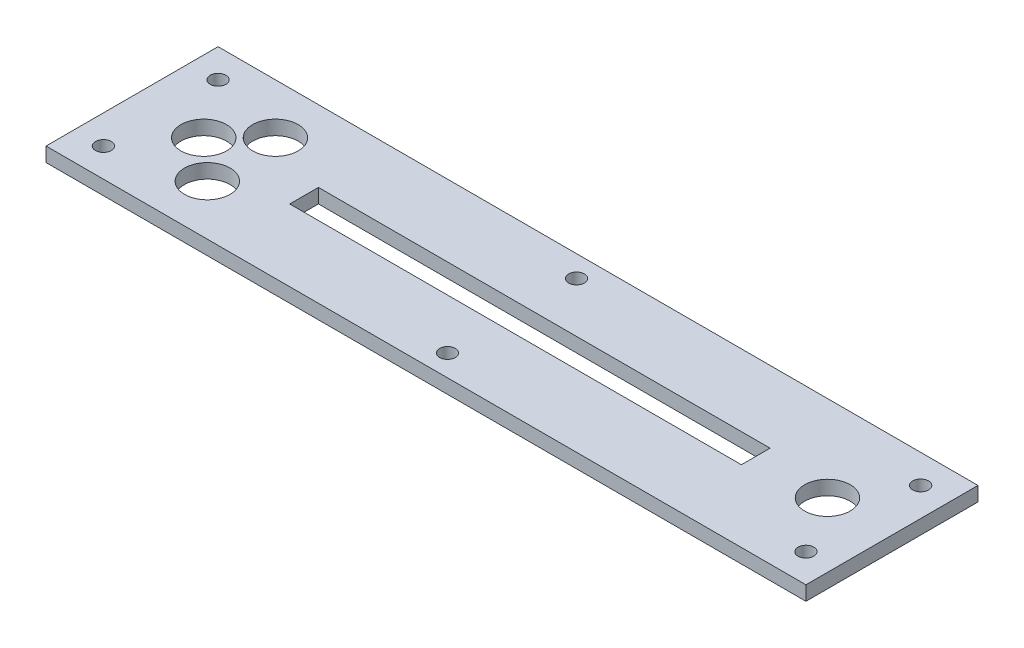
ISO-10303-21;
HEADER;
FILE_DESCRIPTION(('STEP AP214'),'2;1');
FILE_NAME('part.step','',(''),(''),'','','');
FILE_SCHEMA(('AUTOMOTIVE_DESIGN { 1 0 10303 214 1 1 1 1 }'));
ENDSEC;
DATA;
#1=APPLICATION_CONTEXT('core data for automotive mechanical design processes');
#2=APPLICATION_PROTOCOL_DEFINITION('international standard','automotive_design',2000,#1);
#3=PRODUCT_CONTEXT('',#1,'mechanical');
#4=PRODUCT('Part','Part','',(#3));
#5=PRODUCT_RELATED_PRODUCT_CATEGORY('part','',(#4));
#6=PRODUCT_DEFINITION_FORMATION('','',#4);
#7=PRODUCT_DEFINITION_CONTEXT('part definition',#1,'design');
#8=PRODUCT_DEFINITION('design','',#6,#7);
#9=PRODUCT_DEFINITION_SHAPE('','',#8);
#10=(LENGTH_UNIT() NAMED_UNIT(*) SI_UNIT(.MILLI.,.METRE.));
#11=(NAMED_UNIT(*) PLANE_ANGLE_UNIT() SI_UNIT($,.RADIAN.));
#12=(NAMED_UNIT(*) SI_UNIT($,.STERADIAN.) SOLID_ANGLE_UNIT());
#13=UNCERTAINTY_MEASURE_WITH_UNIT(LENGTH_MEASURE(1.E-05),#10,'distance_accuracy_value','');
#14=(GEOMETRIC_REPRESENTATION_CONTEXT(3) GLOBAL_UNCERTAINTY_ASSIGNED_CONTEXT((#13)) GLOBAL_UNIT_ASSIGNED_CONTEXT((#10,
#11,#12)) REPRESENTATION_CONTEXT('',''));
#15=CARTESIAN_POINT('',(0.,0.,0.));
#16=DIRECTION('',(0.,0.,1.));
#17=DIRECTION('',(1.,0.,0.));
#18=AXIS2_PLACEMENT_3D('',#15,#16,#17);
#19=CARTESIAN_POINT('',(0.,2.,0.));
#20=DIRECTION('',(0.,1.,0.));
#21=DIRECTION('',(0.,0.,1.));
#22=AXIS2_PLACEMENT_3D('',#19,#20,#21);
#23=PLANE('',#22);
#24=CARTESIAN_POINT('',(-0.5,2.,9.00000000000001));
#25=DIRECTION('',(0.,1.,0.));
#26=DIRECTION('',(0.,0.,1.));
#27=AXIS2_PLACEMENT_3D('',#24,#25,#26);
#28=CIRCLE('',#27,1.1);
#29=CARTESIAN_POINT('',(-0.5,2.,10.1));
#30=VERTEX_POINT('',#29);
#31=EDGE_CURVE('E270',#30,#30,#28,.T.);
#32=ORIENTED_EDGE('',*,*,#31,.F.);
#33=EDGE_LOOP('',(#32));
#34=FACE_BOUND('',#33,.T.);
#35=CARTESIAN_POINT('',(48.5,2.,8.));
#36=DIRECTION('',(0.,1.,0.));
#37=DIRECTION('',(0.,0.,1.));
#38=AXIS2_PLACEMENT_3D('',#35,#36,#37);
#39=CIRCLE('',#38,1.1);
#40=CARTESIAN_POINT('',(48.5,2.,9.1));
#41=VERTEX_POINT('',#40);
#42=EDGE_CURVE('E282',#41,#41,#39,.T.);
#43=ORIENTED_EDGE('',*,*,#42,.F.);
#44=EDGE_LOOP('',(#43));
#45=FACE_BOUND('',#44,.T.);
#46=CARTESIAN_POINT('',(-38.,2.,5.));
#47=DIRECTION('',(0.,1.,0.));
#48=DIRECTION('',(0.,0.,1.));
#49=AXIS2_PLACEMENT_3D('',#46,#47,#48);
#50=CIRCLE('',#49,3.18);
#51=CARTESIAN_POINT('',(-38.,2.,8.18));
#52=VERTEX_POINT('',#51);
#53=EDGE_CURVE('E294',#52,#52,#50,.T.);
#54=ORIENTED_EDGE('',*,*,#53,.F.);
#55=EDGE_LOOP('',(#54));
#56=FACE_BOUND('',#55,.T.);
#57=CARTESIAN_POINT('',(-38.5,2.,-5.));
#58=DIRECTION('',(0.,1.,0.));
#59=DIRECTION('',(0.,0.,1.));
#60=AXIS2_PLACEMENT_3D('',#57,#58,#59);
#61=CIRCLE('',#60,3.18);
#62=CARTESIAN_POINT('',(-38.5,2.,-1.82));
#63=VERTEX_POINT('',#62);
#64=EDGE_CURVE('E306',#63,#63,#61,.T.);
#65=ORIENTED_EDGE('',*,*,#64,.F.);
#66=EDGE_LOOP('',(#65));
#67=FACE_BOUND('',#66,.T.);
#68=CARTESIAN_POINT('',(-49.5,2.,-7.99999999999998));
#69=DIRECTION('',(0.,1.,0.));
#70=DIRECTION('',(0.,0.,1.));
#71=AXIS2_PLACEMENT_3D('',#68,#69,#70);
#72=CIRCLE('',#71,1.1);
#73=CARTESIAN_POINT('',(-49.5,2.,-6.89999999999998));
#74=VERTEX_POINT('',#73);
#75=EDGE_CURVE('E127',#74,#74,#72,.T.);
#76=ORIENTED_EDGE('',*,*,#75,.F.);
#77=EDGE_LOOP('',(#76));
#78=FACE_BOUND('',#77,.T.);
#79=DIRECTION('',(-1.,0.,0.));
#80=VECTOR('',#79,1.);
#81=CARTESIAN_POINT('',(52.5,2.,-12.));
#82=LINE('',#81,#80);
#83=CARTESIAN_POINT('',(52.5,2.,-12.));
#84=VERTEX_POINT('',#83);
#85=CARTESIAN_POINT('',(-53.5,2.,-12.));
#86=VERTEX_POINT('',#85);
#87=EDGE_CURVE('E137',#84,#86,#82,.T.);
#88=ORIENTED_EDGE('',*,*,#87,.T.);
#89=DIRECTION('',(0.,0.,1.));
#90=VECTOR('',#89,1.);
#91=CARTESIAN_POINT('',(-53.5,2.,-12.));
#92=LINE('',#91,#90);
#93=CARTESIAN_POINT('',(-53.5,2.,12.));
#94=VERTEX_POINT('',#93);
#95=EDGE_CURVE('E140',#86,#94,#92,.T.);
#96=ORIENTED_EDGE('',*,*,#95,.T.);
#97=DIRECTION('',(1.,0.,0.));
#98=VECTOR('',#97,1.);
#99=CARTESIAN_POINT('',(52.5,2.,12.));
#100=LINE('',#99,#98);
#101=CARTESIAN_POINT('',(52.5,2.,12.));
#102=VERTEX_POINT('',#101);
#103=EDGE_CURVE('E143',#94,#102,#100,.T.);
#104=ORIENTED_EDGE('',*,*,#103,.T.);
#105=DIRECTION('',(0.,0.,-1.));
#106=VECTOR('',#105,1.);
#107=CARTESIAN_POINT('',(52.5,2.,12.));
#108=LINE('',#107,#106);
#109=EDGE_CURVE('E145',#102,#84,#108,.T.);
#110=ORIENTED_EDGE('',*,*,#109,.T.);
#111=EDGE_LOOP('',(#88,#96,#104,#110));
#112=FACE_BOUND('',#111,.T.);
#113=DIRECTION('',(1.,0.,0.));
#114=VECTOR('',#113,1.);
#115=CARTESIAN_POINT('',(-29.5,2.,2.));
#116=LINE('',#115,#114);
#117=CARTESIAN_POINT('',(-29.5,2.,2.));
#118=VERTEX_POINT('',#117);
#119=CARTESIAN_POINT('',(33.5,2.,2.));
#120=VERTEX_POINT('',#119);
#121=EDGE_CURVE('E106',#118,#120,#116,.T.);
#122=ORIENTED_EDGE('',*,*,#121,.F.);
#123=DIRECTION('',(0.,0.,1.));
#124=VECTOR('',#123,1.);
#125=CARTESIAN_POINT('',(-29.5,2.,-2.));
#126=LINE('',#125,#124);
#127=CARTESIAN_POINT('',(-29.5,2.,-2.));
#128=VERTEX_POINT('',#127);
#129=EDGE_CURVE('E98',#128,#118,#126,.T.);
#130=ORIENTED_EDGE('',*,*,#129,.F.);
#131=DIRECTION('',(-1.,0.,0.));
#132=VECTOR('',#131,1.);
#133=CARTESIAN_POINT('',(-29.5,2.,-2.));
#134=LINE('',#133,#132);
#135=CARTESIAN_POINT('',(33.5,2.,-2.));
#136=VERTEX_POINT('',#135);
#137=EDGE_CURVE('E121',#136,#128,#134,.T.);
#138=ORIENTED_EDGE('',*,*,#137,.F.);
#139=DIRECTION('',(0.,0.,-1.));
#140=VECTOR('',#139,1.);
#141=CARTESIAN_POINT('',(33.5,2.,-2.));
#142=LINE('',#141,#140);
#143=EDGE_CURVE('E119',#120,#136,#142,.T.);
#144=ORIENTED_EDGE('',*,*,#143,.F.);
#145=EDGE_LOOP('',(#122,#130,#138,#144));
#146=FACE_BOUND('',#145,.T.);
#147=CARTESIAN_POINT('',(-49.5,2.,8.00000000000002));
#148=DIRECTION('',(0.,1.,0.));
#149=DIRECTION('',(0.,0.,1.));
#150=AXIS2_PLACEMENT_3D('',#147,#148,#149);
#151=CIRCLE('',#150,1.1);
#152=CARTESIAN_POINT('',(-49.5,2.,9.10000000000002));
#153=VERTEX_POINT('',#152);
#154=EDGE_CURVE('E312',#153,#153,#151,.T.);
#155=ORIENTED_EDGE('',*,*,#154,.F.);
#156=EDGE_LOOP('',(#155));
#157=FACE_BOUND('',#156,.T.);
#158=CARTESIAN_POINT('',(-43.5,2.,0.));
#159=DIRECTION('',(0.,1.,0.));
#160=DIRECTION('',(0.,0.,1.));
#161=AXIS2_PLACEMENT_3D('',#158,#159,#160);
#162=CIRCLE('',#161,3.18);
#163=CARTESIAN_POINT('',(-43.5,2.,3.18000000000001));
#164=VERTEX_POINT('',#163);
#165=EDGE_CURVE('E300',#164,#164,#162,.T.);
#166=ORIENTED_EDGE('',*,*,#165,.F.);
#167=EDGE_LOOP('',(#166));
#168=FACE_BOUND('',#167,.T.);
#169=CARTESIAN_POINT('',(43.5,2.,0.));
#170=DIRECTION('',(0.,1.,0.));
#171=DIRECTION('',(0.,0.,1.));
#172=AXIS2_PLACEMENT_3D('',#169,#170,#171);
#173=CIRCLE('',#172,3.18);
#174=CARTESIAN_POINT('',(43.5,2.,3.18));
#175=VERTEX_POINT('',#174);
#176=EDGE_CURVE('E288',#175,#175,#173,.T.);
#177=ORIENTED_EDGE('',*,*,#176,.F.);
#178=EDGE_LOOP('',(#177));
#179=FACE_BOUND('',#178,.T.);
#180=CARTESIAN_POINT('',(48.5,2.,-8.));
#181=DIRECTION('',(0.,1.,0.));
#182=DIRECTION('',(0.,0.,1.));
#183=AXIS2_PLACEMENT_3D('',#180,#181,#182);
#184=CIRCLE('',#183,1.1);
#185=CARTESIAN_POINT('',(48.5,2.,-6.9));
#186=VERTEX_POINT('',#185);
#187=EDGE_CURVE('E276',#186,#186,#184,.T.);
#188=ORIENTED_EDGE('',*,*,#187,.F.);
#189=EDGE_LOOP('',(#188));
#190=FACE_BOUND('',#189,.T.);
#191=CARTESIAN_POINT('',(-0.5,2.,-8.99999999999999));
#192=DIRECTION('',(0.,1.,0.));
#193=DIRECTION('',(0.,0.,1.));
#194=AXIS2_PLACEMENT_3D('',#191,#192,#193);
#195=CIRCLE('',#194,1.1);
#196=CARTESIAN_POINT('',(-0.5,2.,-7.89999999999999));
#197=VERTEX_POINT('',#196);
#198=EDGE_CURVE('E261',#197,#197,#195,.T.);
#199=ORIENTED_EDGE('',*,*,#198,.F.);
#200=EDGE_LOOP('',(#199));
#201=FACE_BOUND('',#200,.T.);
#202=ADVANCED_FACE('F33',(#34,#45,#56,#67,#78,#112,#146,#157,#168,#179,#190,#201),#23,.T.);
#203=CARTESIAN_POINT('',(0.,0.,0.));
#204=DIRECTION('',(0.,1.,0.));
#205=DIRECTION('',(0.,0.,1.));
#206=AXIS2_PLACEMENT_3D('',#203,#204,#205);
#207=PLANE('',#206);
#208=CARTESIAN_POINT('',(-0.5,0.,9.00000000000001));
#209=DIRECTION('',(0.,1.,0.));
#210=DIRECTION('',(0.,0.,1.));
#211=AXIS2_PLACEMENT_3D('',#208,#209,#210);
#212=CIRCLE('',#211,1.1);
#213=CARTESIAN_POINT('',(-0.5,0.,10.1));
#214=VERTEX_POINT('',#213);
#215=EDGE_CURVE('E267',#214,#214,#212,.T.);
#216=ORIENTED_EDGE('',*,*,#215,.T.);
#217=EDGE_LOOP('',(#216));
#218=FACE_BOUND('',#217,.T.);
#219=CARTESIAN_POINT('',(48.5,0.,8.));
#220=DIRECTION('',(0.,1.,0.));
#221=DIRECTION('',(0.,0.,1.));
#222=AXIS2_PLACEMENT_3D('',#219,#220,#221);
#223=CIRCLE('',#222,1.1);
#224=CARTESIAN_POINT('',(48.5,0.,9.1));
#225=VERTEX_POINT('',#224);
#226=EDGE_CURVE('E279',#225,#225,#223,.T.);
#227=ORIENTED_EDGE('',*,*,#226,.T.);
#228=EDGE_LOOP('',(#227));
#229=FACE_BOUND('',#228,.T.);
#230=CARTESIAN_POINT('',(-38.,0.,5.));
#231=DIRECTION('',(0.,1.,0.));
#232=DIRECTION('',(0.,0.,1.));
#233=AXIS2_PLACEMENT_3D('',#230,#231,#232);
#234=CIRCLE('',#233,3.18);
#235=CARTESIAN_POINT('',(-38.,0.,8.18));
#236=VERTEX_POINT('',#235);
#237=EDGE_CURVE('E291',#236,#236,#234,.T.);
#238=ORIENTED_EDGE('',*,*,#237,.T.);
#239=EDGE_LOOP('',(#238));
#240=FACE_BOUND('',#239,.T.);
#241=CARTESIAN_POINT('',(-38.5,0.,-5.));
#242=DIRECTION('',(0.,1.,0.));
#243=DIRECTION('',(0.,0.,1.));
#244=AXIS2_PLACEMENT_3D('',#241,#242,#243);
#245=CIRCLE('',#244,3.18);
#246=CARTESIAN_POINT('',(-38.5,0.,-1.82));
#247=VERTEX_POINT('',#246);
#248=EDGE_CURVE('E303',#247,#247,#245,.T.);
#249=ORIENTED_EDGE('',*,*,#248,.T.);
#250=EDGE_LOOP('',(#249));
#251=FACE_BOUND('',#250,.T.);
#252=CARTESIAN_POINT('',(-49.5,0.,-7.99999999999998));
#253=DIRECTION('',(0.,1.,0.));
#254=DIRECTION('',(0.,0.,1.));
#255=AXIS2_PLACEMENT_3D('',#252,#253,#254);
#256=CIRCLE('',#255,1.1);
#257=CARTESIAN_POINT('',(-49.5,0.,-6.89999999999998));
#258=VERTEX_POINT('',#257);
#259=EDGE_CURVE('E315',#258,#258,#256,.T.);
#260=ORIENTED_EDGE('',*,*,#259,.T.);
#261=EDGE_LOOP('',(#260));
#262=FACE_BOUND('',#261,.T.);
#263=DIRECTION('',(-1.,0.,0.));
#264=VECTOR('',#263,1.);
#265=CARTESIAN_POINT('',(52.5,0.,-12.));
#266=LINE('',#265,#264);
#267=CARTESIAN_POINT('',(52.5,0.,-12.));
#268=VERTEX_POINT('',#267);
#269=CARTESIAN_POINT('',(-53.5,0.,-12.));
#270=VERTEX_POINT('',#269);
#271=EDGE_CURVE('E114',#268,#270,#266,.T.);
#272=ORIENTED_EDGE('',*,*,#271,.F.);
#273=DIRECTION('',(0.,0.,-1.));
#274=VECTOR('',#273,1.);
#275=CARTESIAN_POINT('',(52.5,0.,12.));
#276=LINE('',#275,#274);
#277=CARTESIAN_POINT('',(52.5,0.,12.));
#278=VERTEX_POINT('',#277);
#279=EDGE_CURVE('E141',#278,#268,#276,.T.);
#280=ORIENTED_EDGE('',*,*,#279,.F.);
#281=DIRECTION('',(1.,0.,0.));
#282=VECTOR('',#281,1.);
#283=CARTESIAN_POINT('',(52.5,0.,12.));
#284=LINE('',#283,#282);
#285=CARTESIAN_POINT('',(-53.5,0.,12.));
#286=VERTEX_POINT('',#285);
#287=EDGE_CURVE('E152',#286,#278,#284,.T.);
#288=ORIENTED_EDGE('',*,*,#287,.F.);
#289=DIRECTION('',(0.,0.,1.));
#290=VECTOR('',#289,1.);
#291=CARTESIAN_POINT('',(-53.5,0.,-12.));
#292=LINE('',#291,#290);
#293=EDGE_CURVE('E150',#270,#286,#292,.T.);
#294=ORIENTED_EDGE('',*,*,#293,.F.);
#295=EDGE_LOOP('',(#272,#280,#288,#294));
#296=FACE_BOUND('',#295,.T.);
#297=DIRECTION('',(0.,0.,1.));
#298=VECTOR('',#297,1.);
#299=CARTESIAN_POINT('',(-29.5,0.,-2.));
#300=LINE('',#299,#298);
#301=CARTESIAN_POINT('',(-29.5,0.,-2.));
#302=VERTEX_POINT('',#301);
#303=CARTESIAN_POINT('',(-29.5,0.,2.));
#304=VERTEX_POINT('',#303);
#305=EDGE_CURVE('E56',#302,#304,#300,.T.);
#306=ORIENTED_EDGE('',*,*,#305,.T.);
#307=DIRECTION('',(1.,0.,0.));
#308=VECTOR('',#307,1.);
#309=CARTESIAN_POINT('',(-29.5,0.,2.));
#310=LINE('',#309,#308);
#311=CARTESIAN_POINT('',(33.5,0.,2.));
#312=VERTEX_POINT('',#311);
#313=EDGE_CURVE('E113',#304,#312,#310,.T.);
#314=ORIENTED_EDGE('',*,*,#313,.T.);
#315=DIRECTION('',(0.,0.,-1.));
#316=VECTOR('',#315,1.);
#317=CARTESIAN_POINT('',(33.5,0.,-2.));
#318=LINE('',#317,#316);
#319=CARTESIAN_POINT('',(33.5,0.,-2.));
#320=VERTEX_POINT('',#319);
#321=EDGE_CURVE('E129',#312,#320,#318,.T.);
#322=ORIENTED_EDGE('',*,*,#321,.T.);
#323=DIRECTION('',(-1.,0.,0.));
#324=VECTOR('',#323,1.);
#325=CARTESIAN_POINT('',(-29.5,0.,-2.));
#326=LINE('',#325,#324);
#327=EDGE_CURVE('E107',#320,#302,#326,.T.);
#328=ORIENTED_EDGE('',*,*,#327,.T.);
#329=EDGE_LOOP('',(#306,#314,#322,#328));
#330=FACE_BOUND('',#329,.T.);
#331=CARTESIAN_POINT('',(-49.5,0.,8.00000000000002));
#332=DIRECTION('',(0.,1.,0.));
#333=DIRECTION('',(0.,0.,1.));
#334=AXIS2_PLACEMENT_3D('',#331,#332,#333);
#335=CIRCLE('',#334,1.1);
#336=CARTESIAN_POINT('',(-49.5,0.,9.10000000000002));
#337=VERTEX_POINT('',#336);
#338=EDGE_CURVE('E309',#337,#337,#335,.T.);
#339=ORIENTED_EDGE('',*,*,#338,.T.);
#340=EDGE_LOOP('',(#339));
#341=FACE_BOUND('',#340,.T.);
#342=CARTESIAN_POINT('',(-43.5,0.,0.));
#343=DIRECTION('',(0.,1.,0.));
#344=DIRECTION('',(0.,0.,1.));
#345=AXIS2_PLACEMENT_3D('',#342,#343,#344);
#346=CIRCLE('',#345,3.18);
#347=CARTESIAN_POINT('',(-43.5,0.,3.18000000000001));
#348=VERTEX_POINT('',#347);
#349=EDGE_CURVE('E297',#348,#348,#346,.T.);
#350=ORIENTED_EDGE('',*,*,#349,.T.);
#351=EDGE_LOOP('',(#350));
#352=FACE_BOUND('',#351,.T.);
#353=CARTESIAN_POINT('',(43.5,0.,0.));
#354=DIRECTION('',(0.,1.,0.));
#355=DIRECTION('',(0.,0.,1.));
#356=AXIS2_PLACEMENT_3D('',#353,#354,#355);
#357=CIRCLE('',#356,3.18);
#358=CARTESIAN_POINT('',(43.5,0.,3.18));
#359=VERTEX_POINT('',#358);
#360=EDGE_CURVE('E285',#359,#359,#357,.T.);
#361=ORIENTED_EDGE('',*,*,#360,.T.);
#362=EDGE_LOOP('',(#361));
#363=FACE_BOUND('',#362,.T.);
#364=CARTESIAN_POINT('',(48.5,0.,-8.));
#365=DIRECTION('',(0.,1.,0.));
#366=DIRECTION('',(0.,0.,1.));
#367=AXIS2_PLACEMENT_3D('',#364,#365,#366);
#368=CIRCLE('',#367,1.1);
#369=CARTESIAN_POINT('',(48.5,0.,-6.9));
#370=VERTEX_POINT('',#369);
#371=EDGE_CURVE('E273',#370,#370,#368,.T.);
#372=ORIENTED_EDGE('',*,*,#371,.T.);
#373=EDGE_LOOP('',(#372));
#374=FACE_BOUND('',#373,.T.);
#375=CARTESIAN_POINT('',(-0.5,0.,-8.99999999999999));
#376=DIRECTION('',(0.,1.,0.));
#377=DIRECTION('',(0.,0.,1.));
#378=AXIS2_PLACEMENT_3D('',#375,#376,#377);
#379=CIRCLE('',#378,1.1);
#380=CARTESIAN_POINT('',(-0.5,0.,-7.89999999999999));
#381=VERTEX_POINT('',#380);
#382=EDGE_CURVE('E264',#381,#381,#379,.T.);
#383=ORIENTED_EDGE('',*,*,#382,.T.);
#384=EDGE_LOOP('',(#383));
#385=FACE_BOUND('',#384,.T.);
#386=ADVANCED_FACE('F170',(#218,#229,#240,#251,#262,#296,#330,#341,#352,#363,#374,#385),#207,.F.);
#387=CARTESIAN_POINT('',(52.5,2.,-12.));
#388=DIRECTION('',(0.,0.,1.));
#389=DIRECTION('',(1.,0.,0.));
#390=AXIS2_PLACEMENT_3D('',#387,#388,#389);
#391=PLANE('',#390);
#392=ORIENTED_EDGE('',*,*,#271,.T.);
#393=DIRECTION('',(0.,-1.,0.));
#394=VECTOR('',#393,1.);
#395=CARTESIAN_POINT('',(-53.5,2.,-12.));
#396=LINE('',#395,#394);
#397=EDGE_CURVE('E11',#86,#270,#396,.T.);
#398=ORIENTED_EDGE('',*,*,#397,.F.);
#399=ORIENTED_EDGE('',*,*,#87,.F.);
#400=DIRECTION('',(0.,-1.,0.));
#401=VECTOR('',#400,1.);
#402=CARTESIAN_POINT('',(52.5,2.,-12.));
#403=LINE('',#402,#401);
#404=EDGE_CURVE('E147',#84,#268,#403,.T.);
#405=ORIENTED_EDGE('',*,*,#404,.T.);
#406=EDGE_LOOP('',(#392,#398,#399,#405));
#407=FACE_BOUND('',#406,.T.);
#408=ADVANCED_FACE('F35',(#407),#391,.F.);
#409=CARTESIAN_POINT('',(-53.5,2.,-12.));
#410=DIRECTION('',(1.,0.,0.));
#411=DIRECTION('',(0.,0.,-1.));
#412=AXIS2_PLACEMENT_3D('',#409,#410,#411);
#413=PLANE('',#412);
#414=ORIENTED_EDGE('',*,*,#293,.T.);
#415=DIRECTION('',(0.,-1.,0.));
#416=VECTOR('',#415,1.);
#417=CARTESIAN_POINT('',(-53.5,2.,12.));
#418=LINE('',#417,#416);
#419=EDGE_CURVE('E41',#94,#286,#418,.T.);
#420=ORIENTED_EDGE('',*,*,#419,.F.);
#421=ORIENTED_EDGE('',*,*,#95,.F.);
#422=ORIENTED_EDGE('',*,*,#397,.T.);
#423=EDGE_LOOP('',(#414,#420,#421,#422));
#424=FACE_BOUND('',#423,.T.);
#425=ADVANCED_FACE('F180',(#424),#413,.F.);
#426=CARTESIAN_POINT('',(52.5,2.,12.));
#427=DIRECTION('',(0.,0.,-1.));
#428=DIRECTION('',(-1.,0.,0.));
#429=AXIS2_PLACEMENT_3D('',#426,#427,#428);
#430=PLANE('',#429);
#431=ORIENTED_EDGE('',*,*,#287,.T.);
#432=DIRECTION('',(0.,-1.,0.));
#433=VECTOR('',#432,1.);
#434=CARTESIAN_POINT('',(52.5,2.,12.));
#435=LINE('',#434,#433);
#436=EDGE_CURVE('E157',#102,#278,#435,.T.);
#437=ORIENTED_EDGE('',*,*,#436,.F.);
#438=ORIENTED_EDGE('',*,*,#103,.F.);
#439=ORIENTED_EDGE('',*,*,#419,.T.);
#440=EDGE_LOOP('',(#431,#437,#438,#439));
#441=FACE_BOUND('',#440,.T.);
#442=ADVANCED_FACE('F164',(#441),#430,.F.);
#443=CARTESIAN_POINT('',(52.5,2.,12.));
#444=DIRECTION('',(-1.,0.,0.));
#445=DIRECTION('',(0.,0.,1.));
#446=AXIS2_PLACEMENT_3D('',#443,#444,#445);
#447=PLANE('',#446);
#448=ORIENTED_EDGE('',*,*,#279,.T.);
#449=ORIENTED_EDGE('',*,*,#404,.F.);
#450=ORIENTED_EDGE('',*,*,#109,.F.);
#451=ORIENTED_EDGE('',*,*,#436,.T.);
#452=EDGE_LOOP('',(#448,#449,#450,#451));
#453=FACE_BOUND('',#452,.T.);
#454=ADVANCED_FACE('F174',(#453),#447,.F.);
#455=CARTESIAN_POINT('',(-29.5,2.,-2.));
#456=DIRECTION('',(1.,0.,0.));
#457=DIRECTION('',(0.,0.,-1.));
#458=AXIS2_PLACEMENT_3D('',#455,#456,#457);
#459=PLANE('',#458);
#460=ORIENTED_EDGE('',*,*,#305,.F.);
#461=DIRECTION('',(0.,-1.,0.));
#462=VECTOR('',#461,1.);
#463=CARTESIAN_POINT('',(-29.5,2.,-2.));
#464=LINE('',#463,#462);
#465=EDGE_CURVE('E102',#128,#302,#464,.T.);
#466=ORIENTED_EDGE('',*,*,#465,.F.);
#467=ORIENTED_EDGE('',*,*,#129,.T.);
#468=DIRECTION('',(0.,-1.,0.));
#469=VECTOR('',#468,1.);
#470=CARTESIAN_POINT('',(-29.5,2.,2.));
#471=LINE('',#470,#469);
#472=EDGE_CURVE('E101',#118,#304,#471,.T.);
#473=ORIENTED_EDGE('',*,*,#472,.T.);
#474=EDGE_LOOP('',(#460,#466,#467,#473));
#475=FACE_BOUND('',#474,.T.);
#476=ADVANCED_FACE('F100',(#475),#459,.T.);
#477=CARTESIAN_POINT('',(-29.5,2.,2.));
#478=DIRECTION('',(0.,0.,-1.));
#479=DIRECTION('',(-1.,0.,0.));
#480=AXIS2_PLACEMENT_3D('',#477,#478,#479);
#481=PLANE('',#480);
#482=ORIENTED_EDGE('',*,*,#313,.F.);
#483=ORIENTED_EDGE('',*,*,#472,.F.);
#484=ORIENTED_EDGE('',*,*,#121,.T.);
#485=DIRECTION('',(0.,-1.,0.));
#486=VECTOR('',#485,1.);
#487=CARTESIAN_POINT('',(33.5,2.,2.));
#488=LINE('',#487,#486);
#489=EDGE_CURVE('E115',#120,#312,#488,.T.);
#490=ORIENTED_EDGE('',*,*,#489,.T.);
#491=EDGE_LOOP('',(#482,#483,#484,#490));
#492=FACE_BOUND('',#491,.T.);
#493=ADVANCED_FACE('F110',(#492),#481,.T.);
#494=CARTESIAN_POINT('',(33.5,2.,-2.));
#495=DIRECTION('',(-1.,0.,0.));
#496=DIRECTION('',(0.,0.,1.));
#497=AXIS2_PLACEMENT_3D('',#494,#495,#496);
#498=PLANE('',#497);
#499=ORIENTED_EDGE('',*,*,#321,.F.);
#500=ORIENTED_EDGE('',*,*,#489,.F.);
#501=ORIENTED_EDGE('',*,*,#143,.T.);
#502=DIRECTION('',(0.,-1.,0.));
#503=VECTOR('',#502,1.);
#504=CARTESIAN_POINT('',(33.5,2.,-2.));
#505=LINE('',#504,#503);
#506=EDGE_CURVE('E48',#136,#320,#505,.T.);
#507=ORIENTED_EDGE('',*,*,#506,.T.);
#508=EDGE_LOOP('',(#499,#500,#501,#507));
#509=FACE_BOUND('',#508,.T.);
#510=ADVANCED_FACE('F207',(#509),#498,.T.);
#511=CARTESIAN_POINT('',(-29.5,2.,-2.));
#512=DIRECTION('',(0.,0.,1.));
#513=DIRECTION('',(1.,0.,0.));
#514=AXIS2_PLACEMENT_3D('',#511,#512,#513);
#515=PLANE('',#514);
#516=ORIENTED_EDGE('',*,*,#327,.F.);
#517=ORIENTED_EDGE('',*,*,#506,.F.);
#518=ORIENTED_EDGE('',*,*,#137,.T.);
#519=ORIENTED_EDGE('',*,*,#465,.T.);
#520=EDGE_LOOP('',(#516,#517,#518,#519));
#521=FACE_BOUND('',#520,.T.);
#522=ADVANCED_FACE('F211',(#521),#515,.T.);
#523=CARTESIAN_POINT('',(-49.5,2.,-7.99999999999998));
#524=DIRECTION('',(0.,-1.,0.));
#525=DIRECTION('',(0.,0.,-1.));
#526=AXIS2_PLACEMENT_3D('',#523,#524,#525);
#527=CYLINDRICAL_SURFACE('',#526,1.1);
#528=ORIENTED_EDGE('',*,*,#75,.T.);
#529=EDGE_LOOP('',(#528));
#530=FACE_BOUND('',#529,.T.);
#531=ORIENTED_EDGE('',*,*,#259,.F.);
#532=EDGE_LOOP('',(#531));
#533=FACE_BOUND('',#532,.T.);
#534=ADVANCED_FACE('F217',(#530,#533),#527,.F.);
#535=CARTESIAN_POINT('',(-49.5,2.,8.00000000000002));
#536=DIRECTION('',(0.,-1.,0.));
#537=DIRECTION('',(0.,0.,-1.));
#538=AXIS2_PLACEMENT_3D('',#535,#536,#537);
#539=CYLINDRICAL_SURFACE('',#538,1.1);
#540=ORIENTED_EDGE('',*,*,#154,.T.);
#541=EDGE_LOOP('',(#540));
#542=FACE_BOUND('',#541,.T.);
#543=ORIENTED_EDGE('',*,*,#338,.F.);
#544=EDGE_LOOP('',(#543));
#545=FACE_BOUND('',#544,.T.);
#546=ADVANCED_FACE('F220',(#542,#545),#539,.F.);
#547=CARTESIAN_POINT('',(-38.5,2.,-5.));
#548=DIRECTION('',(0.,-1.,0.));
#549=DIRECTION('',(0.,0.,-1.));
#550=AXIS2_PLACEMENT_3D('',#547,#548,#549);
#551=CYLINDRICAL_SURFACE('',#550,3.18);
#552=ORIENTED_EDGE('',*,*,#64,.T.);
#553=EDGE_LOOP('',(#552));
#554=FACE_BOUND('',#553,.T.);
#555=ORIENTED_EDGE('',*,*,#248,.F.);
#556=EDGE_LOOP('',(#555));
#557=FACE_BOUND('',#556,.T.);
#558=ADVANCED_FACE('F224',(#554,#557),#551,.F.);
#559=CARTESIAN_POINT('',(-43.5,2.,0.));
#560=DIRECTION('',(0.,-1.,0.));
#561=DIRECTION('',(0.,0.,-1.));
#562=AXIS2_PLACEMENT_3D('',#559,#560,#561);
#563=CYLINDRICAL_SURFACE('',#562,3.18);
#564=ORIENTED_EDGE('',*,*,#165,.T.);
#565=EDGE_LOOP('',(#564));
#566=FACE_BOUND('',#565,.T.);
#567=ORIENTED_EDGE('',*,*,#349,.F.);
#568=EDGE_LOOP('',(#567));
#569=FACE_BOUND('',#568,.T.);
#570=ADVANCED_FACE('F228',(#566,#569),#563,.F.);
#571=CARTESIAN_POINT('',(-38.,2.,5.));
#572=DIRECTION('',(0.,-1.,0.));
#573=DIRECTION('',(0.,0.,-1.));
#574=AXIS2_PLACEMENT_3D('',#571,#572,#573);
#575=CYLINDRICAL_SURFACE('',#574,3.18);
#576=ORIENTED_EDGE('',*,*,#53,.T.);
#577=EDGE_LOOP('',(#576));
#578=FACE_BOUND('',#577,.T.);
#579=ORIENTED_EDGE('',*,*,#237,.F.);
#580=EDGE_LOOP('',(#579));
#581=FACE_BOUND('',#580,.T.);
#582=ADVANCED_FACE('F232',(#578,#581),#575,.F.);
#583=CARTESIAN_POINT('',(43.5,2.,0.));
#584=DIRECTION('',(0.,-1.,0.));
#585=DIRECTION('',(0.,0.,-1.));
#586=AXIS2_PLACEMENT_3D('',#583,#584,#585);
#587=CYLINDRICAL_SURFACE('',#586,3.18);
#588=ORIENTED_EDGE('',*,*,#176,.T.);
#589=EDGE_LOOP('',(#588));
#590=FACE_BOUND('',#589,.T.);
#591=ORIENTED_EDGE('',*,*,#360,.F.);
#592=EDGE_LOOP('',(#591));
#593=FACE_BOUND('',#592,.T.);
#594=ADVANCED_FACE('F236',(#590,#593),#587,.F.);
#595=CARTESIAN_POINT('',(48.5,2.,8.));
#596=DIRECTION('',(0.,-1.,0.));
#597=DIRECTION('',(0.,0.,-1.));
#598=AXIS2_PLACEMENT_3D('',#595,#596,#597);
#599=CYLINDRICAL_SURFACE('',#598,1.1);
#600=ORIENTED_EDGE('',*,*,#42,.T.);
#601=EDGE_LOOP('',(#600));
#602=FACE_BOUND('',#601,.T.);
#603=ORIENTED_EDGE('',*,*,#226,.F.);
#604=EDGE_LOOP('',(#603));
#605=FACE_BOUND('',#604,.T.);
#606=ADVANCED_FACE('F240',(#602,#605),#599,.F.);
#607=CARTESIAN_POINT('',(48.5,2.,-8.));
#608=DIRECTION('',(0.,-1.,0.));
#609=DIRECTION('',(0.,0.,-1.));
#610=AXIS2_PLACEMENT_3D('',#607,#608,#609);
#611=CYLINDRICAL_SURFACE('',#610,1.1);
#612=ORIENTED_EDGE('',*,*,#187,.T.);
#613=EDGE_LOOP('',(#612));
#614=FACE_BOUND('',#613,.T.);
#615=ORIENTED_EDGE('',*,*,#371,.F.);
#616=EDGE_LOOP('',(#615));
#617=FACE_BOUND('',#616,.T.);
#618=ADVANCED_FACE('F244',(#614,#617),#611,.F.);
#619=CARTESIAN_POINT('',(-0.5,2.,9.00000000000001));
#620=DIRECTION('',(0.,-1.,0.));
#621=DIRECTION('',(0.,0.,-1.));
#622=AXIS2_PLACEMENT_3D('',#619,#620,#621);
#623=CYLINDRICAL_SURFACE('',#622,1.1);
#624=ORIENTED_EDGE('',*,*,#31,.T.);
#625=EDGE_LOOP('',(#624));
#626=FACE_BOUND('',#625,.T.);
#627=ORIENTED_EDGE('',*,*,#215,.F.);
#628=EDGE_LOOP('',(#627));
#629=FACE_BOUND('',#628,.T.);
#630=ADVANCED_FACE('F248',(#626,#629),#623,.F.);
#631=CARTESIAN_POINT('',(-0.5,2.,-8.99999999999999));
#632=DIRECTION('',(0.,-1.,0.));
#633=DIRECTION('',(0.,0.,-1.));
#634=AXIS2_PLACEMENT_3D('',#631,#632,#633);
#635=CYLINDRICAL_SURFACE('',#634,1.1);
#636=ORIENTED_EDGE('',*,*,#198,.T.);
#637=EDGE_LOOP('',(#636));
#638=FACE_BOUND('',#637,.T.);
#639=ORIENTED_EDGE('',*,*,#382,.F.);
#640=EDGE_LOOP('',(#639));
#641=FACE_BOUND('',#640,.T.);
#642=ADVANCED_FACE('F252',(#638,#641),#635,.F.);
#643=CLOSED_SHELL('',(#202,#386,#408,#425,#442,#454,#476,#493,#510,#522,#534,#546,#558,#570,
#582,#594,#606,#618,#630,#642));
#644=MANIFOLD_SOLID_BREP('B2',#643);
#645=ADVANCED_BREP_SHAPE_REPRESENTATION('',(#18,#644),#14);
#646=SHAPE_DEFINITION_REPRESENTATION(#9,#645);
ENDSEC;
END-ISO-10303-21;
